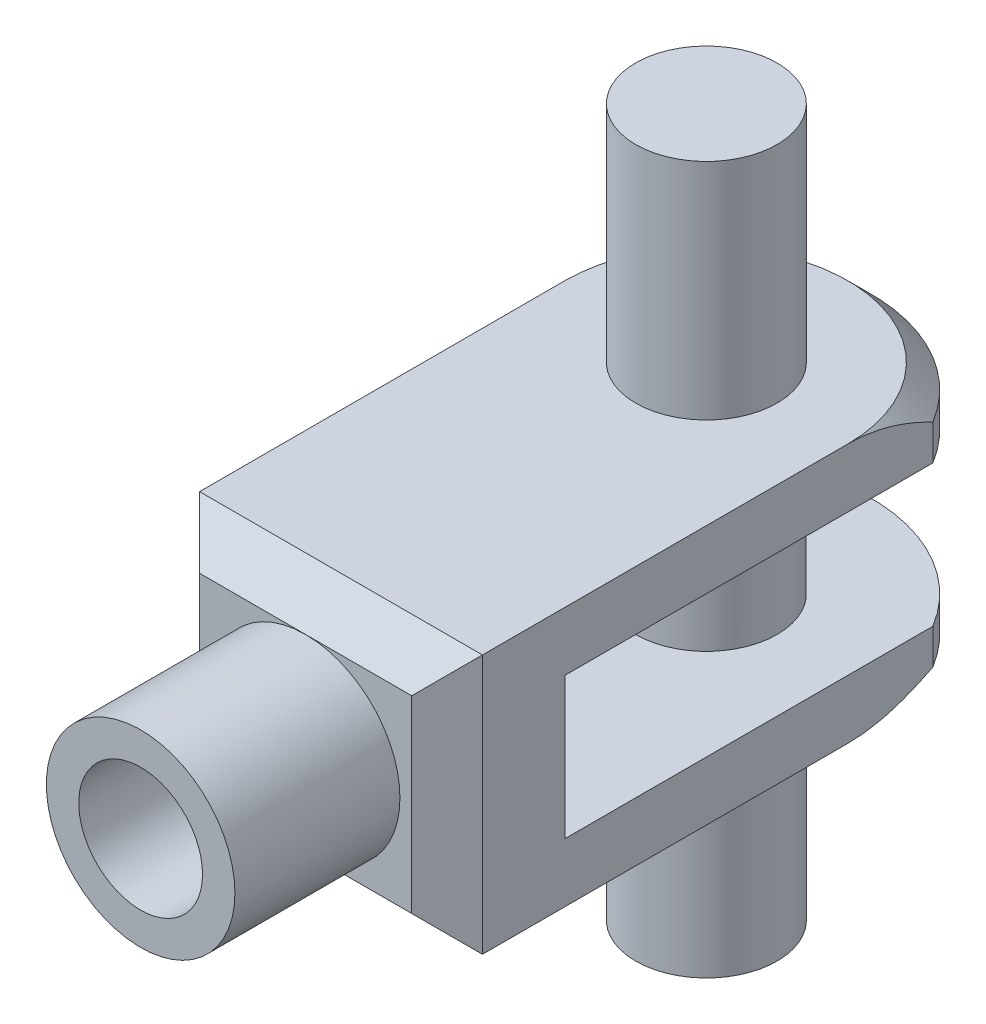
ISO-10303-21;
HEADER;
FILE_DESCRIPTION(('STEP AP214'),'2;1');
FILE_NAME('part.step','',(''),(''),'','','');
FILE_SCHEMA(('AUTOMOTIVE_DESIGN { 1 0 10303 214 1 1 1 1 }'));
ENDSEC;
DATA;
#1=APPLICATION_CONTEXT('core data for automotive mechanical design processes');
#2=APPLICATION_PROTOCOL_DEFINITION('international standard','automotive_design',2000,#1);
#3=PRODUCT_CONTEXT('',#1,'mechanical');
#4=PRODUCT('Part','Part','',(#3));
#5=PRODUCT_RELATED_PRODUCT_CATEGORY('part','',(#4));
#6=PRODUCT_DEFINITION_FORMATION('','',#4);
#7=PRODUCT_DEFINITION_CONTEXT('part definition',#1,'design');
#8=PRODUCT_DEFINITION('design','',#6,#7);
#9=PRODUCT_DEFINITION_SHAPE('','',#8);
#10=(LENGTH_UNIT() NAMED_UNIT(*) SI_UNIT(.MILLI.,.METRE.));
#11=(NAMED_UNIT(*) PLANE_ANGLE_UNIT() SI_UNIT($,.RADIAN.));
#12=(NAMED_UNIT(*) SI_UNIT($,.STERADIAN.) SOLID_ANGLE_UNIT());
#13=UNCERTAINTY_MEASURE_WITH_UNIT(LENGTH_MEASURE(1.E-05),#10,'distance_accuracy_value','');
#14=(GEOMETRIC_REPRESENTATION_CONTEXT(3) GLOBAL_UNCERTAINTY_ASSIGNED_CONTEXT((#13)) GLOBAL_UNIT_ASSIGNED_CONTEXT((#10,
#11,#12)) REPRESENTATION_CONTEXT('',''));
#15=CARTESIAN_POINT('',(0.,0.,0.));
#16=DIRECTION('',(0.,0.,1.));
#17=DIRECTION('',(1.,0.,0.));
#18=AXIS2_PLACEMENT_3D('',#15,#16,#17);
#19=CARTESIAN_POINT('',(12.,11.,-14.));
#20=DIRECTION('',(0.,0.,1.));
#21=DIRECTION('',(1.,0.,0.));
#22=AXIS2_PLACEMENT_3D('',#19,#20,#21);
#23=PLANE('',#22);
#24=DIRECTION('',(0.,1.,0.));
#25=VECTOR('',#24,1.);
#26=CARTESIAN_POINT('',(8.99999999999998,11.,-14.));
#27=LINE('',#26,#25);
#28=CARTESIAN_POINT('',(8.99999999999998,-7.99999999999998,-14.));
#29=VERTEX_POINT('',#28);
#30=CARTESIAN_POINT('',(8.99999999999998,7.99999999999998,-14.));
#31=VERTEX_POINT('',#30);
#32=EDGE_CURVE('E524',#29,#31,#27,.T.);
#33=ORIENTED_EDGE('',*,*,#32,.T.);
#34=DIRECTION('',(-1.,0.,0.));
#35=VECTOR('',#34,1.);
#36=CARTESIAN_POINT('',(12.,7.99999999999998,-14.));
#37=LINE('',#36,#35);
#38=CARTESIAN_POINT('',(0.,7.99999999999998,-14.));
#39=VERTEX_POINT('',#38);
#40=EDGE_CURVE('E542',#31,#39,#37,.T.);
#41=ORIENTED_EDGE('',*,*,#40,.T.);
#42=CARTESIAN_POINT('',(0.,0.,-14.));
#43=DIRECTION('',(0.,0.,1.));
#44=DIRECTION('',(1.,0.,0.));
#45=AXIS2_PLACEMENT_3D('',#42,#43,#44);
#46=CIRCLE('',#45,8.);
#47=CARTESIAN_POINT('',(0.,-7.99999999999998,-14.));
#48=VERTEX_POINT('',#47);
#49=EDGE_CURVE('E512',#39,#48,#46,.F.);
#50=ORIENTED_EDGE('',*,*,#49,.T.);
#51=DIRECTION('',(1.,0.,0.));
#52=VECTOR('',#51,1.);
#53=CARTESIAN_POINT('',(12.,-7.99999999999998,-14.));
#54=LINE('',#53,#52);
#55=EDGE_CURVE('E534',#48,#29,#54,.T.);
#56=ORIENTED_EDGE('',*,*,#55,.T.);
#57=EDGE_LOOP('',(#33,#41,#50,#56));
#58=FACE_BOUND('',#57,.T.);
#59=ADVANCED_FACE('F369',(#58),#23,.T.);
#60=CARTESIAN_POINT('',(0.,11.,-48.));
#61=DIRECTION('',(0.,-1.,0.));
#62=DIRECTION('',(0.,0.,-1.));
#63=AXIS2_PLACEMENT_3D('',#60,#61,#62);
#64=CYLINDRICAL_SURFACE('',#63,14.);
#65=DIRECTION('',(0.,-1.,0.));
#66=VECTOR('',#65,1.);
#67=CARTESIAN_POINT('',(-12.,11.,-55.211102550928));
#68=LINE('',#67,#66);
#69=CARTESIAN_POINT('',(-12.,8.99999999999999,-55.211102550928));
#70=VERTEX_POINT('',#69);
#71=CARTESIAN_POINT('',(-12.,6.00000000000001,-55.211102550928));
#72=VERTEX_POINT('',#71);
#73=EDGE_CURVE('E510',#70,#72,#68,.T.);
#74=ORIENTED_EDGE('',*,*,#73,.F.);
#75=CARTESIAN_POINT('',(0.,8.99999999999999,-48.));
#76=DIRECTION('',(0.,1.,0.));
#77=DIRECTION('',(0.,0.,1.));
#78=AXIS2_PLACEMENT_3D('',#75,#76,#77);
#79=CIRCLE('',#78,14.);
#80=CARTESIAN_POINT('',(12.,8.99999999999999,-55.211102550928));
#81=VERTEX_POINT('',#80);
#82=EDGE_CURVE('E710',#70,#81,#79,.F.);
#83=ORIENTED_EDGE('',*,*,#82,.T.);
#84=DIRECTION('',(0.,-1.,0.));
#85=VECTOR('',#84,1.);
#86=CARTESIAN_POINT('',(12.,11.,-55.211102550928));
#87=LINE('',#86,#85);
#88=CARTESIAN_POINT('',(12.,6.00000000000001,-55.211102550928));
#89=VERTEX_POINT('',#88);
#90=EDGE_CURVE('E507',#81,#89,#87,.T.);
#91=ORIENTED_EDGE('',*,*,#90,.T.);
#92=CARTESIAN_POINT('',(0.,6.00000000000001,-48.));
#93=DIRECTION('',(0.,-1.,0.));
#94=DIRECTION('',(0.,0.,-1.));
#95=AXIS2_PLACEMENT_3D('',#92,#93,#94);
#96=CIRCLE('',#95,14.);
#97=EDGE_CURVE('E475',#72,#89,#96,.T.);
#98=ORIENTED_EDGE('',*,*,#97,.F.);
#99=EDGE_LOOP('',(#74,#83,#91,#98));
#100=FACE_BOUND('',#99,.T.);
#101=ADVANCED_FACE('F583',(#100),#64,.T.);
#102=CARTESIAN_POINT('',(12.,-6.,-55.211102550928));
#103=VERTEX_POINT('',#102);
#104=CARTESIAN_POINT('',(12.,-8.99999999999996,-55.211102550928));
#105=VERTEX_POINT('',#104);
#106=EDGE_CURVE('E506',#103,#105,#87,.T.);
#107=ORIENTED_EDGE('',*,*,#106,.T.);
#108=CARTESIAN_POINT('',(0.,-8.99999999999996,-48.));
#109=DIRECTION('',(0.,1.,0.));
#110=DIRECTION('',(0.,0.,1.));
#111=AXIS2_PLACEMENT_3D('',#108,#109,#110);
#112=CIRCLE('',#111,14.);
#113=CARTESIAN_POINT('',(-12.,-8.99999999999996,-55.211102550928));
#114=VERTEX_POINT('',#113);
#115=EDGE_CURVE('E377',#105,#114,#112,.T.);
#116=ORIENTED_EDGE('',*,*,#115,.T.);
#117=CARTESIAN_POINT('',(-12.,-6.,-55.211102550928));
#118=VERTEX_POINT('',#117);
#119=EDGE_CURVE('E509',#118,#114,#68,.T.);
#120=ORIENTED_EDGE('',*,*,#119,.F.);
#121=CARTESIAN_POINT('',(0.,-6.,-48.));
#122=DIRECTION('',(0.,1.,0.));
#123=DIRECTION('',(0.,0.,1.));
#124=AXIS2_PLACEMENT_3D('',#121,#122,#123);
#125=CIRCLE('',#124,14.);
#126=EDGE_CURVE('E470',#103,#118,#125,.T.);
#127=ORIENTED_EDGE('',*,*,#126,.F.);
#128=EDGE_LOOP('',(#107,#116,#120,#127));
#129=FACE_BOUND('',#128,.T.);
#130=ADVANCED_FACE('F580',(#129),#64,.T.);
#131=CARTESIAN_POINT('',(-12.,11.,-55.211102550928));
#132=DIRECTION('',(1.,0.,0.));
#133=DIRECTION('',(0.,0.,-1.));
#134=AXIS2_PLACEMENT_3D('',#131,#132,#133);
#135=PLANE('',#134);
#136=DIRECTION('',(0.,0.,1.));
#137=VECTOR('',#136,1.);
#138=CARTESIAN_POINT('',(-12.,11.,-55.211102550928));
#139=LINE('',#138,#137);
#140=CARTESIAN_POINT('',(-12.,11.,-48.));
#141=VERTEX_POINT('',#140);
#142=CARTESIAN_POINT('',(-12.,11.,-17.0000000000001));
#143=VERTEX_POINT('',#142);
#144=EDGE_CURVE('E501',#141,#143,#139,.T.);
#145=ORIENTED_EDGE('',*,*,#144,.F.);
#146=CARTESIAN_POINT('',(-12.,11.,-48.));
#147=CARTESIAN_POINT('',(-12.,11.0000214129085,-48.1843229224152));
#148=CARTESIAN_POINT('',(-12.,10.9957537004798,-48.3686385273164));
#149=CARTESIAN_POINT('',(-12.,10.9787990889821,-48.7368539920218));
#150=CARTESIAN_POINT('',(-12.,10.9661135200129,-48.9207539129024));
#151=CARTESIAN_POINT('',(-12.,10.9325122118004,-49.2874674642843));
#152=CARTESIAN_POINT('',(-12.,10.9116112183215,-49.4702824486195));
#153=CARTESIAN_POINT('',(-12.,10.8618801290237,-49.8348229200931));
#154=CARTESIAN_POINT('',(-12.,10.8330498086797,-50.0165483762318));
#155=CARTESIAN_POINT('',(-12.,10.7362131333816,-50.5540687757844));
#156=CARTESIAN_POINT('',(-12.,10.6573121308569,-50.9079425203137));
#157=CARTESIAN_POINT('',(-12.,10.4736423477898,-51.6089144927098));
#158=CARTESIAN_POINT('',(-12.,10.3688647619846,-51.9560103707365));
#159=CARTESIAN_POINT('',(-12.,10.1690364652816,-52.5484780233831));
#160=CARTESIAN_POINT('',(-12.,10.0792021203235,-52.7956353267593));
#161=CARTESIAN_POINT('',(-12.,9.88931415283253,-53.2859392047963));
#162=CARTESIAN_POINT('',(-12.,9.78926216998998,-53.5290864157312));
#163=CARTESIAN_POINT('',(-12.,9.57898969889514,-54.014310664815));
#164=CARTESIAN_POINT('',(-12.,9.46866373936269,-54.2563417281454));
#165=CARTESIAN_POINT('',(-12.,9.24003231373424,-54.736551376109));
#166=CARTESIAN_POINT('',(-12.,9.12172848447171,-54.9747307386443));
#167=CARTESIAN_POINT('',(-12.,8.99999999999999,-55.211102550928));
#168=B_SPLINE_CURVE_WITH_KNOTS('',3,(#146,#147,#148,#149,#150,#151,#152,#153,#154,#155,#156,
#157,#158,#159,#160,#161,#162,#163,#164,#165,#166,#167),.UNSPECIFIED.,.F.,.F.,(4,2,2,2,2,2,2,2,
2,2,4),(0.,0.552907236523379,1.1057271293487,1.65755927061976,2.20940703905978,3.29587572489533,
4.38271462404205,5.17141242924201,5.95998386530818,6.75780132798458,7.55545559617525),.UNSPECIFIED.);
#169=EDGE_CURVE('E566',#141,#70,#168,.T.);
#170=ORIENTED_EDGE('',*,*,#169,.T.);
#171=ORIENTED_EDGE('',*,*,#73,.T.);
#172=DIRECTION('',(0.,0.,-1.));
#173=VECTOR('',#172,1.);
#174=CARTESIAN_POINT('',(-12.,6.00000000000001,-55.211102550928));
#175=LINE('',#174,#173);
#176=CARTESIAN_POINT('',(-12.,6.,-24.));
#177=VERTEX_POINT('',#176);
#178=EDGE_CURVE('E492',#177,#72,#175,.T.);
#179=ORIENTED_EDGE('',*,*,#178,.F.);
#180=DIRECTION('',(0.,-1.,0.));
#181=VECTOR('',#180,1.);
#182=CARTESIAN_POINT('',(-12.,11.,-24.));
#183=LINE('',#182,#181);
#184=CARTESIAN_POINT('',(-12.,-5.99999999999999,-24.));
#185=VERTEX_POINT('',#184);
#186=EDGE_CURVE('E480',#177,#185,#183,.T.);
#187=ORIENTED_EDGE('',*,*,#186,.T.);
#188=DIRECTION('',(0.,0.,1.));
#189=VECTOR('',#188,1.);
#190=CARTESIAN_POINT('',(-12.,-6.,-55.211102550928));
#191=LINE('',#190,#189);
#192=EDGE_CURVE('E464',#118,#185,#191,.T.);
#193=ORIENTED_EDGE('',*,*,#192,.F.);
#194=ORIENTED_EDGE('',*,*,#119,.T.);
#195=CARTESIAN_POINT('',(-12.,-8.99999999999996,-55.211102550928));
#196=CARTESIAN_POINT('',(-12.,-9.12806214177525,-54.9624254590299));
#197=CARTESIAN_POINT('',(-12.,-9.25234002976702,-54.7117441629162));
#198=CARTESIAN_POINT('',(-12.,-9.49205083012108,-54.2060044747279));
#199=CARTESIAN_POINT('',(-12.,-9.60747817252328,-53.9509434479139));
#200=CARTESIAN_POINT('',(-12.,-9.82881741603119,-53.4345909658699));
#201=CARTESIAN_POINT('',(-12.,-9.93465732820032,-53.1732684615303));
#202=CARTESIAN_POINT('',(-12.,-10.1342830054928,-52.6460927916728));
#203=CARTESIAN_POINT('',(-12.,-10.2280711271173,-52.3802405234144));
#204=CARTESIAN_POINT('',(-12.,-10.3992217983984,-51.8522758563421));
#205=CARTESIAN_POINT('',(-12.,-10.4769999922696,-51.590298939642));
#206=CARTESIAN_POINT('',(-12.,-10.6179957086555,-51.0624628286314));
#207=CARTESIAN_POINT('',(-12.,-10.6812151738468,-50.796604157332));
#208=CARTESIAN_POINT('',(-12.,-10.7913922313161,-50.2623471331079));
#209=CARTESIAN_POINT('',(-12.,-10.8383976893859,-49.9939587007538));
#210=CARTESIAN_POINT('',(-12.,-10.9150815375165,-49.4547758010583));
#211=CARTESIAN_POINT('',(-12.,-10.9447670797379,-49.1839823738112));
#212=CARTESIAN_POINT('',(-12.,-10.9710959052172,-48.8368144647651));
#213=CARTESIAN_POINT('',(-12.,-10.9761313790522,-48.761023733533));
#214=CARTESIAN_POINT('',(-12.,-10.9847767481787,-48.6093550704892));
#215=CARTESIAN_POINT('',(-12.,-10.9883865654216,-48.5334771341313));
#216=CARTESIAN_POINT('',(-12.,-10.9970890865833,-48.3051260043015));
#217=CARTESIAN_POINT('',(-12.,-11.0000068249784,-48.1525668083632));
#218=CARTESIAN_POINT('',(-12.,-11.,-48.));
#219=B_SPLINE_CURVE_WITH_KNOTS('',3,(#195,#196,#197,#198,#199,#200,#201,#202,#203,#204,#205,
#206,#207,#208,#209,#210,#211,#212,#213,#214,#215,#216,#217,#218),.UNSPECIFIED.,.F.,.F.,(4,2,2,
2,2,2,2,2,2,2,2,4),(0.,0.839184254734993,1.67889237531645,2.52445769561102,3.36985742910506,
4.18932133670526,5.00867583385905,5.82559036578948,6.64216731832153,6.87003275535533,
7.09791066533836,7.55556460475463),.UNSPECIFIED.);
#220=CARTESIAN_POINT('',(-12.,-11.,-48.));
#221=VERTEX_POINT('',#220);
#222=EDGE_CURVE('E559',#114,#221,#219,.T.);
#223=ORIENTED_EDGE('',*,*,#222,.T.);
#224=DIRECTION('',(0.,0.,1.));
#225=VECTOR('',#224,1.);
#226=CARTESIAN_POINT('',(-12.,-11.,-55.211102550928));
#227=LINE('',#226,#225);
#228=CARTESIAN_POINT('',(-12.,-11.,-17.0000000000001));
#229=VERTEX_POINT('',#228);
#230=EDGE_CURVE('E493',#221,#229,#227,.T.);
#231=ORIENTED_EDGE('',*,*,#230,.T.);
#232=DIRECTION('',(0.,1.,0.));
#233=VECTOR('',#232,1.);
#234=CARTESIAN_POINT('',(-12.,11.,-17.0000000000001));
#235=LINE('',#234,#233);
#236=EDGE_CURVE('E548',#229,#143,#235,.T.);
#237=ORIENTED_EDGE('',*,*,#236,.T.);
#238=EDGE_LOOP('',(#145,#170,#171,#179,#187,#193,#194,#223,#231,#237));
#239=FACE_BOUND('',#238,.T.);
#240=ADVANCED_FACE('F490',(#239),#135,.F.);
#241=CARTESIAN_POINT('',(12.,11.,-14.));
#242=DIRECTION('',(-1.,0.,0.));
#243=DIRECTION('',(0.,0.,1.));
#244=AXIS2_PLACEMENT_3D('',#241,#242,#243);
#245=PLANE('',#244);
#246=ORIENTED_EDGE('',*,*,#90,.F.);
#247=CARTESIAN_POINT('',(12.,8.99999999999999,-55.211102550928));
#248=CARTESIAN_POINT('',(12.,9.12806214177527,-54.9624254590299));
#249=CARTESIAN_POINT('',(12.,9.25234002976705,-54.7117441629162));
#250=CARTESIAN_POINT('',(12.,9.49205083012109,-54.2060044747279));
#251=CARTESIAN_POINT('',(12.,9.60747817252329,-53.9509434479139));
#252=CARTESIAN_POINT('',(12.,9.82881741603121,-53.4345909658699));
#253=CARTESIAN_POINT('',(12.,9.93465732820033,-53.1732684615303));
#254=CARTESIAN_POINT('',(12.,10.1342830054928,-52.6460927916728));
#255=CARTESIAN_POINT('',(12.,10.2280711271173,-52.3802405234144));
#256=CARTESIAN_POINT('',(12.,10.3992217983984,-51.8522758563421));
#257=CARTESIAN_POINT('',(12.,10.4769999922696,-51.590298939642));
#258=CARTESIAN_POINT('',(12.,10.6179957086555,-51.0624628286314));
#259=CARTESIAN_POINT('',(12.,10.6812151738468,-50.7966041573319));
#260=CARTESIAN_POINT('',(12.,10.7913922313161,-50.2623471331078));
#261=CARTESIAN_POINT('',(12.,10.8383976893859,-49.9939587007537));
#262=CARTESIAN_POINT('',(12.,10.9150815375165,-49.4547758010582));
#263=CARTESIAN_POINT('',(12.,10.9447670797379,-49.1839823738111));
#264=CARTESIAN_POINT('',(12.,10.9710959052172,-48.836814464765));
#265=CARTESIAN_POINT('',(12.,10.9761313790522,-48.761023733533));
#266=CARTESIAN_POINT('',(12.,10.9847767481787,-48.6093550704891));
#267=CARTESIAN_POINT('',(12.,10.9883865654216,-48.5334771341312));
#268=CARTESIAN_POINT('',(12.,10.9970890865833,-48.3051260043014));
#269=CARTESIAN_POINT('',(12.,11.0000068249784,-48.1525668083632));
#270=CARTESIAN_POINT('',(12.,11.,-48.));
#271=B_SPLINE_CURVE_WITH_KNOTS('',3,(#247,#248,#249,#250,#251,#252,#253,#254,#255,#256,#257,
#258,#259,#260,#261,#262,#263,#264,#265,#266,#267,#268,#269,#270),.UNSPECIFIED.,.F.,.F.,(4,2,2,
2,2,2,2,2,2,2,2,4),(0.,0.839184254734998,1.67889237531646,2.52445769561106,3.3698574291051,
4.18932133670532,5.00867583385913,5.82559036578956,6.64216731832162,6.87003275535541,
7.09791066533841,7.55556460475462),.UNSPECIFIED.);
#272=CARTESIAN_POINT('',(12.,11.,-48.));
#273=VERTEX_POINT('',#272);
#274=EDGE_CURVE('E660',#81,#273,#271,.T.);
#275=ORIENTED_EDGE('',*,*,#274,.T.);
#276=DIRECTION('',(0.,0.,-1.));
#277=VECTOR('',#276,1.);
#278=CARTESIAN_POINT('',(12.,11.,-14.));
#279=LINE('',#278,#277);
#280=CARTESIAN_POINT('',(12.,11.,-17.0000000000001));
#281=VERTEX_POINT('',#280);
#282=EDGE_CURVE('E503',#281,#273,#279,.T.);
#283=ORIENTED_EDGE('',*,*,#282,.F.);
#284=DIRECTION('',(0.,-1.,0.));
#285=VECTOR('',#284,1.);
#286=CARTESIAN_POINT('',(12.,-11.,-17.0000000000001));
#287=LINE('',#286,#285);
#288=CARTESIAN_POINT('',(12.,-11.,-17.0000000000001));
#289=VERTEX_POINT('',#288);
#290=EDGE_CURVE('E554',#281,#289,#287,.T.);
#291=ORIENTED_EDGE('',*,*,#290,.T.);
#292=DIRECTION('',(0.,0.,-1.));
#293=VECTOR('',#292,1.);
#294=CARTESIAN_POINT('',(12.,-11.,-14.));
#295=LINE('',#294,#293);
#296=CARTESIAN_POINT('',(12.,-11.,-48.));
#297=VERTEX_POINT('',#296);
#298=EDGE_CURVE('E495',#289,#297,#295,.T.);
#299=ORIENTED_EDGE('',*,*,#298,.T.);
#300=CARTESIAN_POINT('',(12.,-11.,-48.));
#301=CARTESIAN_POINT('',(12.,-11.0000214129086,-48.1843229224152));
#302=CARTESIAN_POINT('',(12.,-10.9957537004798,-48.3686385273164));
#303=CARTESIAN_POINT('',(12.,-10.9787990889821,-48.7368539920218));
#304=CARTESIAN_POINT('',(12.,-10.9661135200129,-48.9207539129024));
#305=CARTESIAN_POINT('',(12.,-10.9325122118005,-49.2874674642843));
#306=CARTESIAN_POINT('',(12.,-10.9116112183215,-49.4702824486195));
#307=CARTESIAN_POINT('',(12.,-10.8618801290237,-49.8348229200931));
#308=CARTESIAN_POINT('',(12.,-10.8330498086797,-50.0165483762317));
#309=CARTESIAN_POINT('',(12.,-10.7362131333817,-50.5540687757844));
#310=CARTESIAN_POINT('',(12.,-10.6573121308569,-50.9079425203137));
#311=CARTESIAN_POINT('',(12.,-10.4736423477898,-51.6089144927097));
#312=CARTESIAN_POINT('',(12.,-10.3688647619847,-51.9560103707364));
#313=CARTESIAN_POINT('',(12.,-10.1690364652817,-52.548478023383));
#314=CARTESIAN_POINT('',(12.,-10.0792021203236,-52.7956353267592));
#315=CARTESIAN_POINT('',(12.,-9.88931415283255,-53.2859392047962));
#316=CARTESIAN_POINT('',(12.,-9.78926216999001,-53.5290864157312));
#317=CARTESIAN_POINT('',(12.,-9.57898969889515,-54.014310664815));
#318=CARTESIAN_POINT('',(12.,-9.46866373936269,-54.2563417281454));
#319=CARTESIAN_POINT('',(12.,-9.24003231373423,-54.736551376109));
#320=CARTESIAN_POINT('',(12.,-9.1217284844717,-54.9747307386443));
#321=CARTESIAN_POINT('',(12.,-8.99999999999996,-55.211102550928));
#322=B_SPLINE_CURVE_WITH_KNOTS('',3,(#300,#301,#302,#303,#304,#305,#306,#307,#308,#309,#310,
#311,#312,#313,#314,#315,#316,#317,#318,#319,#320,#321),.UNSPECIFIED.,.F.,.F.,(4,2,2,2,2,2,2,2,
2,2,4),(0.,0.552907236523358,1.10572712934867,1.65755927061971,2.20940703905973,
3.29587572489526,4.38271462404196,5.17141242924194,5.95998386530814,6.75780132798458,
7.55545559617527),.UNSPECIFIED.);
#323=EDGE_CURVE('E384',#297,#105,#322,.T.);
#324=ORIENTED_EDGE('',*,*,#323,.T.);
#325=ORIENTED_EDGE('',*,*,#106,.F.);
#326=DIRECTION('',(0.,0.,-1.));
#327=VECTOR('',#326,1.);
#328=CARTESIAN_POINT('',(12.,-5.99999999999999,-14.));
#329=LINE('',#328,#327);
#330=CARTESIAN_POINT('',(12.,-6.,-24.));
#331=VERTEX_POINT('',#330);
#332=EDGE_CURVE('E519',#331,#103,#329,.T.);
#333=ORIENTED_EDGE('',*,*,#332,.F.);
#334=DIRECTION('',(0.,1.,0.));
#335=VECTOR('',#334,1.);
#336=CARTESIAN_POINT('',(12.,11.,-24.));
#337=LINE('',#336,#335);
#338=CARTESIAN_POINT('',(12.,6.,-24.));
#339=VERTEX_POINT('',#338);
#340=EDGE_CURVE('E483',#331,#339,#337,.T.);
#341=ORIENTED_EDGE('',*,*,#340,.T.);
#342=DIRECTION('',(0.,0.,1.));
#343=VECTOR('',#342,1.);
#344=CARTESIAN_POINT('',(12.,6.,-14.));
#345=LINE('',#344,#343);
#346=EDGE_CURVE('E522',#89,#339,#345,.T.);
#347=ORIENTED_EDGE('',*,*,#346,.F.);
#348=EDGE_LOOP('',(#246,#275,#283,#291,#299,#324,#325,#333,#341,#347));
#349=FACE_BOUND('',#348,.T.);
#350=ADVANCED_FACE('F579',(#349),#245,.F.);
#351=CARTESIAN_POINT('',(0.,0.,-14.));
#352=DIRECTION('',(0.,0.,1.));
#353=DIRECTION('',(1.,0.,0.));
#354=AXIS2_PLACEMENT_3D('',#351,#352,#353);
#355=CYLINDRICAL_SURFACE('',#354,8.);
#356=EDGE_CURVE('E513',#48,#39,#46,.F.);
#357=ORIENTED_EDGE('',*,*,#356,.F.);
#358=ORIENTED_EDGE('',*,*,#49,.F.);
#359=EDGE_LOOP('',(#357,#358));
#360=FACE_BOUND('',#359,.T.);
#361=CARTESIAN_POINT('',(0.,0.,0.));
#362=DIRECTION('',(0.,0.,1.));
#363=DIRECTION('',(1.,0.,0.));
#364=AXIS2_PLACEMENT_3D('',#361,#362,#363);
#365=CIRCLE('',#364,8.);
#366=CARTESIAN_POINT('',(8.,0.,0.));
#367=VERTEX_POINT('',#366);
#368=EDGE_CURVE('E516',#367,#367,#365,.T.);
#369=ORIENTED_EDGE('',*,*,#368,.F.);
#370=EDGE_LOOP('',(#369));
#371=FACE_BOUND('',#370,.T.);
#372=ADVANCED_FACE('F371',(#360,#371),#355,.T.);
#373=CARTESIAN_POINT('',(0.,0.,0.));
#374=DIRECTION('',(0.,0.,1.));
#375=DIRECTION('',(1.,0.,0.));
#376=AXIS2_PLACEMENT_3D('',#373,#374,#375);
#377=PLANE('',#376);
#378=CARTESIAN_POINT('',(0.,0.,0.));
#379=DIRECTION('',(0.,0.,1.));
#380=DIRECTION('',(1.,0.,0.));
#381=AXIS2_PLACEMENT_3D('',#378,#379,#380);
#382=CIRCLE('',#381,5.25);
#383=CARTESIAN_POINT('',(5.25,0.,0.));
#384=VERTEX_POINT('',#383);
#385=EDGE_CURVE('E532',#384,#384,#382,.T.);
#386=ORIENTED_EDGE('',*,*,#385,.F.);
#387=EDGE_LOOP('',(#386));
#388=FACE_BOUND('',#387,.T.);
#389=ORIENTED_EDGE('',*,*,#368,.T.);
#390=EDGE_LOOP('',(#389));
#391=FACE_BOUND('',#390,.T.);
#392=ADVANCED_FACE('F587',(#388,#391),#377,.T.);
#393=ORIENTED_EDGE('',*,*,#356,.T.);
#394=DIRECTION('',(-1.,0.,0.));
#395=VECTOR('',#394,1.);
#396=CARTESIAN_POINT('',(12.,7.99999999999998,-14.));
#397=LINE('',#396,#395);
#398=CARTESIAN_POINT('',(-8.99999999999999,7.99999999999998,-14.));
#399=VERTEX_POINT('',#398);
#400=EDGE_CURVE('E540',#39,#399,#397,.T.);
#401=ORIENTED_EDGE('',*,*,#400,.T.);
#402=DIRECTION('',(0.,-1.,0.));
#403=VECTOR('',#402,1.);
#404=CARTESIAN_POINT('',(-8.99999999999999,-11.,-14.));
#405=LINE('',#404,#403);
#406=CARTESIAN_POINT('',(-8.99999999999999,-7.99999999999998,-14.));
#407=VERTEX_POINT('',#406);
#408=EDGE_CURVE('E538',#399,#407,#405,.T.);
#409=ORIENTED_EDGE('',*,*,#408,.T.);
#410=DIRECTION('',(1.,0.,0.));
#411=VECTOR('',#410,1.);
#412=CARTESIAN_POINT('',(12.,-7.99999999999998,-14.));
#413=LINE('',#412,#411);
#414=EDGE_CURVE('E536',#407,#48,#413,.T.);
#415=ORIENTED_EDGE('',*,*,#414,.T.);
#416=EDGE_LOOP('',(#393,#401,#409,#415));
#417=FACE_BOUND('',#416,.T.);
#418=ADVANCED_FACE('F581',(#417),#23,.T.);
#419=CARTESIAN_POINT('',(0.,11.,-48.));
#420=DIRECTION('',(0.,1.,0.));
#421=DIRECTION('',(0.,0.,1.));
#422=AXIS2_PLACEMENT_3D('',#419,#420,#421);
#423=PLANE('',#422);
#424=CARTESIAN_POINT('',(0.,11.,-48.));
#425=DIRECTION('',(0.,1.,0.));
#426=DIRECTION('',(0.,0.,1.));
#427=AXIS2_PLACEMENT_3D('',#424,#425,#426);
#428=CIRCLE('',#427,6.);
#429=CARTESIAN_POINT('',(0.,11.,-42.));
#430=VERTEX_POINT('',#429);
#431=EDGE_CURVE('E528',#430,#430,#428,.T.);
#432=ORIENTED_EDGE('',*,*,#431,.F.);
#433=EDGE_LOOP('',(#432));
#434=FACE_BOUND('',#433,.T.);
#435=ORIENTED_EDGE('',*,*,#282,.T.);
#436=CARTESIAN_POINT('',(0.,11.,-48.));
#437=DIRECTION('',(0.,1.,0.));
#438=DIRECTION('',(0.,0.,1.));
#439=AXIS2_PLACEMENT_3D('',#436,#437,#438);
#440=CIRCLE('',#439,12.);
#441=EDGE_CURVE('E556',#273,#141,#440,.T.);
#442=ORIENTED_EDGE('',*,*,#441,.T.);
#443=ORIENTED_EDGE('',*,*,#144,.T.);
#444=DIRECTION('',(1.,0.,0.));
#445=VECTOR('',#444,1.);
#446=CARTESIAN_POINT('',(0.,11.,-17.0000000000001));
#447=LINE('',#446,#445);
#448=EDGE_CURVE('E545',#143,#281,#447,.T.);
#449=ORIENTED_EDGE('',*,*,#448,.T.);
#450=EDGE_LOOP('',(#435,#442,#443,#449));
#451=FACE_BOUND('',#450,.T.);
#452=ADVANCED_FACE('F595',(#434,#451),#423,.T.);
#453=CARTESIAN_POINT('',(0.,-11.,-48.));
#454=DIRECTION('',(0.,1.,0.));
#455=DIRECTION('',(0.,0.,1.));
#456=AXIS2_PLACEMENT_3D('',#453,#454,#455);
#457=PLANE('',#456);
#458=CARTESIAN_POINT('',(0.,-11.,-48.));
#459=DIRECTION('',(0.,1.,0.));
#460=DIRECTION('',(0.,0.,1.));
#461=AXIS2_PLACEMENT_3D('',#458,#459,#460);
#462=CIRCLE('',#461,6.);
#463=CARTESIAN_POINT('',(0.,-11.,-42.));
#464=VERTEX_POINT('',#463);
#465=EDGE_CURVE('E743',#464,#464,#462,.F.);
#466=ORIENTED_EDGE('',*,*,#465,.F.);
#467=EDGE_LOOP('',(#466));
#468=FACE_BOUND('',#467,.T.);
#469=ORIENTED_EDGE('',*,*,#230,.F.);
#470=CARTESIAN_POINT('',(0.,-11.,-48.));
#471=DIRECTION('',(0.,1.,0.));
#472=DIRECTION('',(0.,0.,1.));
#473=AXIS2_PLACEMENT_3D('',#470,#471,#472);
#474=CIRCLE('',#473,12.);
#475=EDGE_CURVE('E11',#221,#297,#474,.F.);
#476=ORIENTED_EDGE('',*,*,#475,.T.);
#477=ORIENTED_EDGE('',*,*,#298,.F.);
#478=DIRECTION('',(-1.,0.,0.));
#479=VECTOR('',#478,1.);
#480=CARTESIAN_POINT('',(-12.,-11.,-17.0000000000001));
#481=LINE('',#480,#479);
#482=EDGE_CURVE('E551',#289,#229,#481,.T.);
#483=ORIENTED_EDGE('',*,*,#482,.T.);
#484=EDGE_LOOP('',(#469,#476,#477,#483));
#485=FACE_BOUND('',#484,.T.);
#486=ADVANCED_FACE('F678',(#468,#485),#457,.F.);
#487=CARTESIAN_POINT('',(-15.,6.,-24.));
#488=DIRECTION('',(0.,0.,1.));
#489=DIRECTION('',(0.,-1.,0.));
#490=AXIS2_PLACEMENT_3D('',#487,#488,#489);
#491=PLANE('',#490);
#492=CARTESIAN_POINT('',(0.,0.,-24.));
#493=DIRECTION('',(0.,0.,1.));
#494=DIRECTION('',(0.,-1.,0.));
#495=AXIS2_PLACEMENT_3D('',#492,#493,#494);
#496=CIRCLE('',#495,5.25);
#497=CARTESIAN_POINT('',(0.,-5.25,-24.));
#498=VERTEX_POINT('',#497);
#499=EDGE_CURVE('E529',#498,#498,#496,.T.);
#500=ORIENTED_EDGE('',*,*,#499,.T.);
#501=EDGE_LOOP('',(#500));
#502=FACE_BOUND('',#501,.T.);
#503=DIRECTION('',(1.,0.,0.));
#504=VECTOR('',#503,1.);
#505=CARTESIAN_POINT('',(-15.,6.,-24.));
#506=LINE('',#505,#504);
#507=EDGE_CURVE('E485',#177,#339,#506,.T.);
#508=ORIENTED_EDGE('',*,*,#507,.T.);
#509=ORIENTED_EDGE('',*,*,#340,.F.);
#510=DIRECTION('',(1.,0.,0.));
#511=VECTOR('',#510,1.);
#512=CARTESIAN_POINT('',(-15.,-5.99999999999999,-24.));
#513=LINE('',#512,#511);
#514=EDGE_CURVE('E468',#185,#331,#513,.T.);
#515=ORIENTED_EDGE('',*,*,#514,.F.);
#516=ORIENTED_EDGE('',*,*,#186,.F.);
#517=EDGE_LOOP('',(#508,#509,#515,#516));
#518=FACE_BOUND('',#517,.T.);
#519=ADVANCED_FACE('F479',(#502,#518),#491,.F.);
#520=CARTESIAN_POINT('',(-15.,6.,-24.));
#521=DIRECTION('',(0.,-1.,0.));
#522=DIRECTION('',(0.,0.,-1.));
#523=AXIS2_PLACEMENT_3D('',#520,#521,#522);
#524=PLANE('',#523);
#525=CARTESIAN_POINT('',(0.,6.00000000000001,-48.));
#526=DIRECTION('',(0.,-1.,0.));
#527=DIRECTION('',(0.,0.,-1.));
#528=AXIS2_PLACEMENT_3D('',#525,#526,#527);
#529=CIRCLE('',#528,6.);
#530=CARTESIAN_POINT('',(0.,6.00000000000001,-54.));
#531=VERTEX_POINT('',#530);
#532=EDGE_CURVE('E486',#531,#531,#529,.T.);
#533=ORIENTED_EDGE('',*,*,#532,.F.);
#534=EDGE_LOOP('',(#533));
#535=FACE_BOUND('',#534,.T.);
#536=ORIENTED_EDGE('',*,*,#178,.T.);
#537=ORIENTED_EDGE('',*,*,#97,.T.);
#538=ORIENTED_EDGE('',*,*,#346,.T.);
#539=ORIENTED_EDGE('',*,*,#507,.F.);
#540=EDGE_LOOP('',(#536,#537,#538,#539));
#541=FACE_BOUND('',#540,.T.);
#542=ADVANCED_FACE('F652',(#535,#541),#524,.T.);
#543=CARTESIAN_POINT('',(-15.,-6.,-62.));
#544=DIRECTION('',(0.,1.,0.));
#545=DIRECTION('',(0.,0.,1.));
#546=AXIS2_PLACEMENT_3D('',#543,#544,#545);
#547=PLANE('',#546);
#548=CARTESIAN_POINT('',(0.,-6.,-48.));
#549=DIRECTION('',(0.,1.,0.));
#550=DIRECTION('',(0.,0.,1.));
#551=AXIS2_PLACEMENT_3D('',#548,#549,#550);
#552=CIRCLE('',#551,6.);
#553=CARTESIAN_POINT('',(0.,-6.,-42.));
#554=VERTEX_POINT('',#553);
#555=EDGE_CURVE('E525',#554,#554,#552,.T.);
#556=ORIENTED_EDGE('',*,*,#555,.F.);
#557=EDGE_LOOP('',(#556));
#558=FACE_BOUND('',#557,.T.);
#559=ORIENTED_EDGE('',*,*,#192,.T.);
#560=ORIENTED_EDGE('',*,*,#514,.T.);
#561=ORIENTED_EDGE('',*,*,#332,.T.);
#562=ORIENTED_EDGE('',*,*,#126,.T.);
#563=EDGE_LOOP('',(#559,#560,#561,#562));
#564=FACE_BOUND('',#563,.T.);
#565=ADVANCED_FACE('F466',(#558,#564),#547,.T.);
#566=CARTESIAN_POINT('',(0.,0.,-62.));
#567=DIRECTION('',(0.,0.,1.));
#568=DIRECTION('',(1.,0.,0.));
#569=AXIS2_PLACEMENT_3D('',#566,#567,#568);
#570=CYLINDRICAL_SURFACE('',#569,5.25);
#571=ORIENTED_EDGE('',*,*,#385,.T.);
#572=EDGE_LOOP('',(#571));
#573=FACE_BOUND('',#572,.T.);
#574=ORIENTED_EDGE('',*,*,#499,.F.);
#575=EDGE_LOOP('',(#574));
#576=FACE_BOUND('',#575,.T.);
#577=ADVANCED_FACE('F686',(#573,#576),#570,.F.);
#578=CARTESIAN_POINT('',(0.,-11.,-17.0000000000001));
#579=DIRECTION('',(0.,-0.707106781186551,0.707106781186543));
#580=DIRECTION('',(0.,-0.707106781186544,-0.707106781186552));
#581=AXIS2_PLACEMENT_3D('',#578,#579,#580);
#582=PLANE('',#581);
#583=DIRECTION('',(-0.577350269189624,-0.577350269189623,-0.57735026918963));
#584=VECTOR('',#583,1.);
#585=CARTESIAN_POINT('',(-8.00000000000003,-7.00000000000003,-13.));
#586=LINE('',#585,#584);
#587=EDGE_CURVE('E620',#229,#407,#586,.F.);
#588=ORIENTED_EDGE('',*,*,#587,.F.);
#589=ORIENTED_EDGE('',*,*,#482,.F.);
#590=DIRECTION('',(0.577350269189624,-0.577350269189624,-0.57735026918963));
#591=VECTOR('',#590,1.);
#592=CARTESIAN_POINT('',(4.66666666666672,-3.66666666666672,-9.66666666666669));
#593=LINE('',#592,#591);
#594=EDGE_CURVE('E636',#29,#289,#593,.T.);
#595=ORIENTED_EDGE('',*,*,#594,.F.);
#596=ORIENTED_EDGE('',*,*,#55,.F.);
#597=ORIENTED_EDGE('',*,*,#414,.F.);
#598=EDGE_LOOP('',(#588,#589,#595,#596,#597));
#599=FACE_BOUND('',#598,.T.);
#600=ADVANCED_FACE('F692',(#599),#582,.T.);
#601=CARTESIAN_POINT('',(12.,11.,-17.0000000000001));
#602=DIRECTION('',(0.707106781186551,0.,0.707106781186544));
#603=DIRECTION('',(0.707106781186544,0.,-0.707106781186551));
#604=AXIS2_PLACEMENT_3D('',#601,#602,#603);
#605=PLANE('',#604);
#606=ORIENTED_EDGE('',*,*,#594,.T.);
#607=ORIENTED_EDGE('',*,*,#290,.F.);
#608=DIRECTION('',(0.577350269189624,0.577350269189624,-0.57735026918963));
#609=VECTOR('',#608,1.);
#610=CARTESIAN_POINT('',(12.,11.,-17.0000000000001));
#611=LINE('',#610,#609);
#612=EDGE_CURVE('E616',#31,#281,#611,.T.);
#613=ORIENTED_EDGE('',*,*,#612,.F.);
#614=ORIENTED_EDGE('',*,*,#32,.F.);
#615=EDGE_LOOP('',(#606,#607,#613,#614));
#616=FACE_BOUND('',#615,.T.);
#617=ADVANCED_FACE('F617',(#616),#605,.T.);
#618=CARTESIAN_POINT('',(-8.99999999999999,11.,-14.));
#619=DIRECTION('',(-0.707106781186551,0.,0.707106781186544));
#620=DIRECTION('',(0.707106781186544,0.,0.707106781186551));
#621=AXIS2_PLACEMENT_3D('',#618,#619,#620);
#622=PLANE('',#621);
#623=ORIENTED_EDGE('',*,*,#587,.T.);
#624=ORIENTED_EDGE('',*,*,#408,.F.);
#625=DIRECTION('',(0.577350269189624,-0.577350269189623,0.57735026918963));
#626=VECTOR('',#625,1.);
#627=CARTESIAN_POINT('',(-9.99999999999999,8.99999999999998,-15.));
#628=LINE('',#627,#626);
#629=EDGE_CURVE('E621',#143,#399,#628,.T.);
#630=ORIENTED_EDGE('',*,*,#629,.F.);
#631=ORIENTED_EDGE('',*,*,#236,.F.);
#632=EDGE_LOOP('',(#623,#624,#630,#631));
#633=FACE_BOUND('',#632,.T.);
#634=ADVANCED_FACE('F631',(#633),#622,.T.);
#635=CARTESIAN_POINT('',(12.,7.99999999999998,-14.));
#636=DIRECTION('',(0.,-0.707106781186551,-0.707106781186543));
#637=DIRECTION('',(0.,0.707106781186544,-0.707106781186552));
#638=AXIS2_PLACEMENT_3D('',#635,#636,#637);
#639=PLANE('',#638);
#640=ORIENTED_EDGE('',*,*,#612,.T.);
#641=ORIENTED_EDGE('',*,*,#448,.F.);
#642=ORIENTED_EDGE('',*,*,#629,.T.);
#643=ORIENTED_EDGE('',*,*,#400,.F.);
#644=ORIENTED_EDGE('',*,*,#40,.F.);
#645=EDGE_LOOP('',(#640,#641,#642,#643,#644));
#646=FACE_BOUND('',#645,.T.);
#647=ADVANCED_FACE('F623',(#646),#639,.F.);
#648=CARTESIAN_POINT('',(0.,11.,-48.));
#649=DIRECTION('',(0.,-1.,0.));
#650=DIRECTION('',(0.,0.,-1.));
#651=AXIS2_PLACEMENT_3D('',#648,#649,#650);
#652=CONICAL_SURFACE('',#651,12.,0.785398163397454);
#653=ORIENTED_EDGE('',*,*,#274,.F.);
#654=ORIENTED_EDGE('',*,*,#82,.F.);
#655=ORIENTED_EDGE('',*,*,#169,.F.);
#656=ORIENTED_EDGE('',*,*,#441,.F.);
#657=EDGE_LOOP('',(#653,#654,#655,#656));
#658=FACE_BOUND('',#657,.T.);
#659=ADVANCED_FACE('F669',(#658),#652,.T.);
#660=CARTESIAN_POINT('',(0.,-8.99999999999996,-48.));
#661=DIRECTION('',(0.,1.,0.));
#662=DIRECTION('',(0.,0.,1.));
#663=AXIS2_PLACEMENT_3D('',#660,#661,#662);
#664=CONICAL_SURFACE('',#663,14.,0.785398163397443);
#665=ORIENTED_EDGE('',*,*,#323,.F.);
#666=ORIENTED_EDGE('',*,*,#475,.F.);
#667=ORIENTED_EDGE('',*,*,#222,.F.);
#668=ORIENTED_EDGE('',*,*,#115,.F.);
#669=EDGE_LOOP('',(#665,#666,#667,#668));
#670=FACE_BOUND('',#669,.T.);
#671=ADVANCED_FACE('F572',(#670),#664,.T.);
#672=CARTESIAN_POINT('',(0.,30.,-48.));
#673=DIRECTION('',(0.,-1.,0.));
#674=DIRECTION('',(0.,0.,-1.));
#675=AXIS2_PLACEMENT_3D('',#672,#673,#674);
#676=CYLINDRICAL_SURFACE('',#675,6.);
#677=ORIENTED_EDGE('',*,*,#532,.T.);
#678=EDGE_LOOP('',(#677));
#679=FACE_BOUND('',#678,.T.);
#680=ORIENTED_EDGE('',*,*,#555,.T.);
#681=EDGE_LOOP('',(#680));
#682=FACE_BOUND('',#681,.T.);
#683=ADVANCED_FACE('F707',(#679,#682),#676,.T.);
#684=CARTESIAN_POINT('',(0.,-30.,-48.));
#685=DIRECTION('',(0.,1.,0.));
#686=DIRECTION('',(0.,0.,1.));
#687=AXIS2_PLACEMENT_3D('',#684,#685,#686);
#688=PLANE('',#687);
#689=CARTESIAN_POINT('',(0.,-30.,-48.));
#690=DIRECTION('',(0.,1.,0.));
#691=DIRECTION('',(0.,0.,1.));
#692=AXIS2_PLACEMENT_3D('',#689,#690,#691);
#693=CIRCLE('',#692,6.);
#694=CARTESIAN_POINT('',(0.,-30.,-42.));
#695=VERTEX_POINT('',#694);
#696=EDGE_CURVE('E744',#695,#695,#693,.T.);
#697=ORIENTED_EDGE('',*,*,#696,.F.);
#698=EDGE_LOOP('',(#697));
#699=FACE_BOUND('',#698,.T.);
#700=ADVANCED_FACE('F718',(#699),#688,.F.);
#701=ORIENTED_EDGE('',*,*,#696,.T.);
#702=EDGE_LOOP('',(#701));
#703=FACE_BOUND('',#702,.T.);
#704=ORIENTED_EDGE('',*,*,#465,.T.);
#705=EDGE_LOOP('',(#704));
#706=FACE_BOUND('',#705,.T.);
#707=ADVANCED_FACE('F720',(#703,#706),#676,.T.);
#708=ORIENTED_EDGE('',*,*,#431,.T.);
#709=EDGE_LOOP('',(#708));
#710=FACE_BOUND('',#709,.T.);
#711=CARTESIAN_POINT('',(0.,30.,-48.));
#712=DIRECTION('',(0.,1.,0.));
#713=DIRECTION('',(0.,0.,1.));
#714=AXIS2_PLACEMENT_3D('',#711,#712,#713);
#715=CIRCLE('',#714,6.);
#716=CARTESIAN_POINT('',(0.,30.,-42.));
#717=VERTEX_POINT('',#716);
#718=EDGE_CURVE('E742',#717,#717,#715,.T.);
#719=ORIENTED_EDGE('',*,*,#718,.F.);
#720=EDGE_LOOP('',(#719));
#721=FACE_BOUND('',#720,.T.);
#722=ADVANCED_FACE('F721',(#710,#721),#676,.T.);
#723=CARTESIAN_POINT('',(0.,30.,-48.));
#724=DIRECTION('',(0.,1.,0.));
#725=DIRECTION('',(0.,0.,1.));
#726=AXIS2_PLACEMENT_3D('',#723,#724,#725);
#727=PLANE('',#726);
#728=ORIENTED_EDGE('',*,*,#718,.T.);
#729=EDGE_LOOP('',(#728));
#730=FACE_BOUND('',#729,.T.);
#731=ADVANCED_FACE('F732',(#730),#727,.T.);
#732=CLOSED_SHELL('',(#59,#101,#130,#240,#350,#372,#392,#418,#452,#486,#519,#542,#565,#577,#600,
#617,#634,#647,#659,#671,#683,#700,#707,#722,#731));
#733=MANIFOLD_SOLID_BREP('B2',#732);
#734=ADVANCED_BREP_SHAPE_REPRESENTATION('',(#18,#733),#14);
#735=SHAPE_DEFINITION_REPRESENTATION(#9,#734);
ENDSEC;
END-ISO-10303-21;
